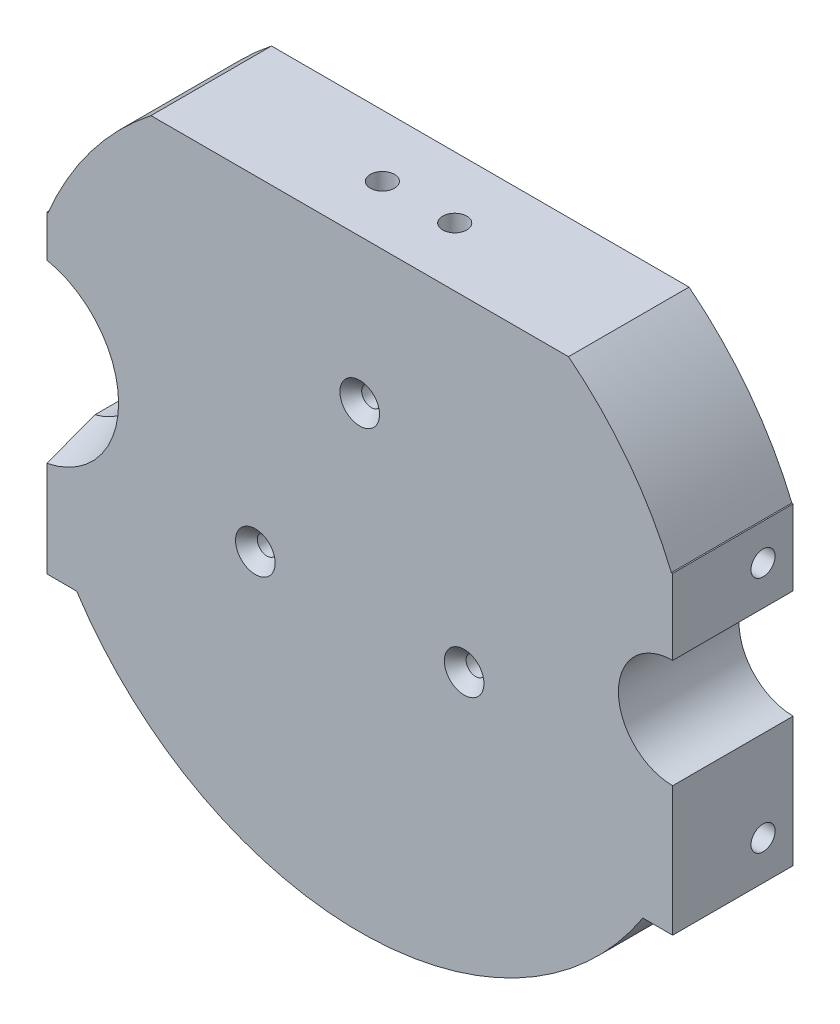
ISO-10303-21;
HEADER;
FILE_DESCRIPTION(('STEP AP214'),'2;1');
FILE_NAME('part.step','',(''),(''),'','','');
FILE_SCHEMA(('AUTOMOTIVE_DESIGN { 1 0 10303 214 1 1 1 1 }'));
ENDSEC;
DATA;
#1=APPLICATION_CONTEXT('core data for automotive mechanical design processes');
#2=APPLICATION_PROTOCOL_DEFINITION('international standard','automotive_design',2000,#1);
#3=PRODUCT_CONTEXT('',#1,'mechanical');
#4=PRODUCT('Part','Part','',(#3));
#5=PRODUCT_RELATED_PRODUCT_CATEGORY('part','',(#4));
#6=PRODUCT_DEFINITION_FORMATION('','',#4);
#7=PRODUCT_DEFINITION_CONTEXT('part definition',#1,'design');
#8=PRODUCT_DEFINITION('design','',#6,#7);
#9=PRODUCT_DEFINITION_SHAPE('','',#8);
#10=(LENGTH_UNIT() NAMED_UNIT(*) SI_UNIT(.MILLI.,.METRE.));
#11=(NAMED_UNIT(*) PLANE_ANGLE_UNIT() SI_UNIT($,.RADIAN.));
#12=(NAMED_UNIT(*) SI_UNIT($,.STERADIAN.) SOLID_ANGLE_UNIT());
#13=UNCERTAINTY_MEASURE_WITH_UNIT(LENGTH_MEASURE(1.E-05),#10,'distance_accuracy_value','');
#14=(GEOMETRIC_REPRESENTATION_CONTEXT(3) GLOBAL_UNCERTAINTY_ASSIGNED_CONTEXT((#13)) GLOBAL_UNIT_ASSIGNED_CONTEXT((#10,
#11,#12)) REPRESENTATION_CONTEXT('',''));
#15=CARTESIAN_POINT('',(0.,0.,0.));
#16=DIRECTION('',(0.,0.,1.));
#17=DIRECTION('',(1.,0.,0.));
#18=AXIS2_PLACEMENT_3D('',#15,#16,#17);
#19=CARTESIAN_POINT('',(0.,0.,-31.75));
#20=DIRECTION('',(0.,0.,1.));
#21=DIRECTION('',(1.,0.,0.));
#22=AXIS2_PLACEMENT_3D('',#19,#20,#21);
#23=CYLINDRICAL_SURFACE('',#22,88.9);
#24=DIRECTION('',(0.,0.,1.));
#25=VECTOR('',#24,1.);
#26=CARTESIAN_POINT('',(54.9926131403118,69.85,-31.75));
#27=LINE('',#26,#25);
#28=CARTESIAN_POINT('',(54.9926131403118,69.85,0.));
#29=VERTEX_POINT('',#28);
#30=CARTESIAN_POINT('',(54.9926131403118,69.85,-31.75));
#31=VERTEX_POINT('',#30);
#32=EDGE_CURVE('E229',#29,#31,#27,.F.);
#33=ORIENTED_EDGE('',*,*,#32,.F.);
#34=CARTESIAN_POINT('',(0.,0.,0.));
#35=DIRECTION('',(0.,0.,1.));
#36=DIRECTION('',(1.,0.,0.));
#37=AXIS2_PLACEMENT_3D('',#34,#35,#36);
#38=CIRCLE('',#37,88.9);
#39=CARTESIAN_POINT('',(82.084311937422,34.1376,0.));
#40=VERTEX_POINT('',#39);
#41=EDGE_CURVE('E296',#40,#29,#38,.T.);
#42=ORIENTED_EDGE('',*,*,#41,.F.);
#43=DIRECTION('',(0.,0.,1.));
#44=VECTOR('',#43,1.);
#45=CARTESIAN_POINT('',(82.084311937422,34.1376,-31.75));
#46=LINE('',#45,#44);
#47=CARTESIAN_POINT('',(82.084311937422,34.1376,-31.75));
#48=VERTEX_POINT('',#47);
#49=EDGE_CURVE('E330',#48,#40,#46,.T.);
#50=ORIENTED_EDGE('',*,*,#49,.F.);
#51=CARTESIAN_POINT('',(0.,0.,-31.75));
#52=DIRECTION('',(0.,0.,1.));
#53=DIRECTION('',(1.,0.,0.));
#54=AXIS2_PLACEMENT_3D('',#51,#52,#53);
#55=CIRCLE('',#54,88.9);
#56=EDGE_CURVE('E256',#48,#31,#55,.T.);
#57=ORIENTED_EDGE('',*,*,#56,.T.);
#58=EDGE_LOOP('',(#33,#42,#50,#57));
#59=FACE_BOUND('',#58,.T.);
#60=ADVANCED_FACE('F44',(#59),#23,.T.);
#61=DIRECTION('',(0.,0.,1.));
#62=VECTOR('',#61,1.);
#63=CARTESIAN_POINT('',(-54.9926131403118,69.85,-31.75));
#64=LINE('',#63,#62);
#65=CARTESIAN_POINT('',(-54.9926131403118,69.85,-31.75));
#66=VERTEX_POINT('',#65);
#67=CARTESIAN_POINT('',(-54.9926131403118,69.85,0.));
#68=VERTEX_POINT('',#67);
#69=EDGE_CURVE('E227',#66,#68,#64,.T.);
#70=ORIENTED_EDGE('',*,*,#69,.F.);
#71=CARTESIAN_POINT('',(-82.084311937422,34.1376,-31.75));
#72=VERTEX_POINT('',#71);
#73=EDGE_CURVE('E261',#66,#72,#55,.T.);
#74=ORIENTED_EDGE('',*,*,#73,.T.);
#75=DIRECTION('',(0.,0.,1.));
#76=VECTOR('',#75,1.);
#77=CARTESIAN_POINT('',(-82.084311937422,34.1376,-31.75));
#78=LINE('',#77,#76);
#79=CARTESIAN_POINT('',(-82.084311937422,34.1376,0.));
#80=VERTEX_POINT('',#79);
#81=EDGE_CURVE('E295',#72,#80,#78,.T.);
#82=ORIENTED_EDGE('',*,*,#81,.T.);
#83=EDGE_CURVE('E255',#68,#80,#38,.T.);
#84=ORIENTED_EDGE('',*,*,#83,.F.);
#85=EDGE_LOOP('',(#70,#74,#82,#84));
#86=FACE_BOUND('',#85,.T.);
#87=ADVANCED_FACE('F387',(#86),#23,.T.);
#88=CARTESIAN_POINT('',(82.084311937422,34.1376,-31.75));
#89=DIRECTION('',(0.,1.,0.));
#90=DIRECTION('',(-1.,0.,0.));
#91=AXIS2_PLACEMENT_3D('',#88,#89,#90);
#92=PLANE('',#91);
#93=DIRECTION('',(-1.,0.,0.));
#94=VECTOR('',#93,1.);
#95=CARTESIAN_POINT('',(82.084311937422,34.1376,0.));
#96=LINE('',#95,#94);
#97=CARTESIAN_POINT('',(82.423,34.1376,0.));
#98=VERTEX_POINT('',#97);
#99=EDGE_CURVE('E327',#98,#40,#96,.T.);
#100=ORIENTED_EDGE('',*,*,#99,.F.);
#101=DIRECTION('',(0.,0.,1.));
#102=VECTOR('',#101,1.);
#103=CARTESIAN_POINT('',(82.423,34.1376,-31.75));
#104=LINE('',#103,#102);
#105=CARTESIAN_POINT('',(82.423,34.1376,-31.75));
#106=VERTEX_POINT('',#105);
#107=EDGE_CURVE('E334',#106,#98,#104,.T.);
#108=ORIENTED_EDGE('',*,*,#107,.F.);
#109=DIRECTION('',(-1.,0.,0.));
#110=VECTOR('',#109,1.);
#111=CARTESIAN_POINT('',(82.084311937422,34.1376,-31.75));
#112=LINE('',#111,#110);
#113=EDGE_CURVE('E292',#106,#48,#112,.T.);
#114=ORIENTED_EDGE('',*,*,#113,.T.);
#115=ORIENTED_EDGE('',*,*,#49,.T.);
#116=EDGE_LOOP('',(#100,#108,#114,#115));
#117=FACE_BOUND('',#116,.T.);
#118=ADVANCED_FACE('F389',(#117),#92,.T.);
#119=CARTESIAN_POINT('',(82.423,34.1376,-31.75));
#120=DIRECTION('',(1.,0.,0.));
#121=DIRECTION('',(0.,0.,-1.));
#122=AXIS2_PLACEMENT_3D('',#119,#120,#121);
#123=PLANE('',#122);
#124=CARTESIAN_POINT('',(82.423,24.6126000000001,-23.8125));
#125=DIRECTION('',(1.,0.,0.));
#126=DIRECTION('',(0.,0.,-1.));
#127=AXIS2_PLACEMENT_3D('',#124,#125,#126);
#128=CIRCLE('',#127,3.175);
#129=CARTESIAN_POINT('',(82.423,24.6126000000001,-26.9875));
#130=VERTEX_POINT('',#129);
#131=EDGE_CURVE('E243',#130,#130,#128,.T.);
#132=ORIENTED_EDGE('',*,*,#131,.F.);
#133=EDGE_LOOP('',(#132));
#134=FACE_BOUND('',#133,.T.);
#135=DIRECTION('',(0.,1.,0.));
#136=VECTOR('',#135,1.);
#137=CARTESIAN_POINT('',(82.423,34.1376,0.));
#138=LINE('',#137,#136);
#139=CARTESIAN_POINT('',(82.423,14.2748,0.));
#140=VERTEX_POINT('',#139);
#141=EDGE_CURVE('E324',#140,#98,#138,.T.);
#142=ORIENTED_EDGE('',*,*,#141,.F.);
#143=DIRECTION('',(0.,0.,1.));
#144=VECTOR('',#143,1.);
#145=CARTESIAN_POINT('',(82.423,14.2748,-31.75));
#146=LINE('',#145,#144);
#147=CARTESIAN_POINT('',(82.423,14.2748,-31.75));
#148=VERTEX_POINT('',#147);
#149=EDGE_CURVE('E337',#148,#140,#146,.T.);
#150=ORIENTED_EDGE('',*,*,#149,.F.);
#151=DIRECTION('',(0.,1.,0.));
#152=VECTOR('',#151,1.);
#153=CARTESIAN_POINT('',(82.423,34.1376,-31.75));
#154=LINE('',#153,#152);
#155=EDGE_CURVE('E289',#148,#106,#154,.T.);
#156=ORIENTED_EDGE('',*,*,#155,.T.);
#157=ORIENTED_EDGE('',*,*,#107,.T.);
#158=EDGE_LOOP('',(#142,#150,#156,#157));
#159=FACE_BOUND('',#158,.T.);
#160=ADVANCED_FACE('F395',(#134,#159),#123,.T.);
#161=CARTESIAN_POINT('',(82.423,-0.0126999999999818,-31.75));
#162=DIRECTION('',(0.,0.,1.));
#163=DIRECTION('',(1.,0.,0.));
#164=AXIS2_PLACEMENT_3D('',#161,#162,#163);
#165=CYLINDRICAL_SURFACE('',#164,14.2875);
#166=CARTESIAN_POINT('',(82.423,-0.0126999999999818,0.));
#167=DIRECTION('',(0.,0.,-1.));
#168=DIRECTION('',(1.,0.,0.));
#169=AXIS2_PLACEMENT_3D('',#166,#167,#168);
#170=CIRCLE('',#169,14.2875);
#171=CARTESIAN_POINT('',(82.423,-14.3002,0.));
#172=VERTEX_POINT('',#171);
#173=EDGE_CURVE('E320',#172,#140,#170,.T.);
#174=ORIENTED_EDGE('',*,*,#173,.F.);
#175=DIRECTION('',(0.,0.,1.));
#176=VECTOR('',#175,1.);
#177=CARTESIAN_POINT('',(82.423,-14.3002,-31.75));
#178=LINE('',#177,#176);
#179=CARTESIAN_POINT('',(82.423,-14.3002,-31.75));
#180=VERTEX_POINT('',#179);
#181=EDGE_CURVE('E339',#180,#172,#178,.T.);
#182=ORIENTED_EDGE('',*,*,#181,.F.);
#183=CARTESIAN_POINT('',(82.423,-0.0126999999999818,-31.75));
#184=DIRECTION('',(0.,0.,-1.));
#185=DIRECTION('',(1.,0.,0.));
#186=AXIS2_PLACEMENT_3D('',#183,#184,#185);
#187=CIRCLE('',#186,14.2875);
#188=EDGE_CURVE('E285',#180,#148,#187,.T.);
#189=ORIENTED_EDGE('',*,*,#188,.T.);
#190=ORIENTED_EDGE('',*,*,#149,.T.);
#191=EDGE_LOOP('',(#174,#182,#189,#190));
#192=FACE_BOUND('',#191,.T.);
#193=ADVANCED_FACE('F427',(#192),#165,.F.);
#194=CARTESIAN_POINT('',(82.423,-14.3002,-31.75));
#195=DIRECTION('',(1.,0.,0.));
#196=DIRECTION('',(0.,0.,-1.));
#197=AXIS2_PLACEMENT_3D('',#194,#195,#196);
#198=PLANE('',#197);
#199=CARTESIAN_POINT('',(82.423,-38.1,-23.8125));
#200=DIRECTION('',(1.,0.,0.));
#201=DIRECTION('',(0.,0.,-1.));
#202=AXIS2_PLACEMENT_3D('',#199,#200,#201);
#203=CIRCLE('',#202,3.175);
#204=CARTESIAN_POINT('',(82.423,-38.1,-26.9875));
#205=VERTEX_POINT('',#204);
#206=EDGE_CURVE('E249',#205,#205,#203,.T.);
#207=ORIENTED_EDGE('',*,*,#206,.F.);
#208=EDGE_LOOP('',(#207));
#209=FACE_BOUND('',#208,.T.);
#210=DIRECTION('',(0.,1.,0.));
#211=VECTOR('',#210,1.);
#212=CARTESIAN_POINT('',(82.423,-14.3002,0.));
#213=LINE('',#212,#211);
#214=CARTESIAN_POINT('',(82.423,-48.4124,0.));
#215=VERTEX_POINT('',#214);
#216=EDGE_CURVE('E316',#215,#172,#213,.T.);
#217=ORIENTED_EDGE('',*,*,#216,.F.);
#218=DIRECTION('',(0.,0.,1.));
#219=VECTOR('',#218,1.);
#220=CARTESIAN_POINT('',(82.423,-48.4124,-31.75));
#221=LINE('',#220,#219);
#222=CARTESIAN_POINT('',(82.423,-48.4124,-31.75));
#223=VERTEX_POINT('',#222);
#224=EDGE_CURVE('E342',#223,#215,#221,.T.);
#225=ORIENTED_EDGE('',*,*,#224,.F.);
#226=DIRECTION('',(0.,1.,0.));
#227=VECTOR('',#226,1.);
#228=CARTESIAN_POINT('',(82.423,-14.3002,-31.75));
#229=LINE('',#228,#227);
#230=EDGE_CURVE('E282',#223,#180,#229,.T.);
#231=ORIENTED_EDGE('',*,*,#230,.T.);
#232=ORIENTED_EDGE('',*,*,#181,.T.);
#233=EDGE_LOOP('',(#217,#225,#231,#232));
#234=FACE_BOUND('',#233,.T.);
#235=ADVANCED_FACE('F430',(#209,#234),#198,.T.);
#236=CARTESIAN_POINT('',(82.423,-48.4124,-31.75));
#237=DIRECTION('',(0.,-1.,0.));
#238=DIRECTION('',(1.,0.,0.));
#239=AXIS2_PLACEMENT_3D('',#236,#237,#238);
#240=PLANE('',#239);
#241=DIRECTION('',(1.,0.,0.));
#242=VECTOR('',#241,1.);
#243=CARTESIAN_POINT('',(82.423,-48.4124,0.));
#244=LINE('',#243,#242);
#245=CARTESIAN_POINT('',(74.5617162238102,-48.4124,0.));
#246=VERTEX_POINT('',#245);
#247=EDGE_CURVE('E313',#246,#215,#244,.T.);
#248=ORIENTED_EDGE('',*,*,#247,.F.);
#249=DIRECTION('',(0.,0.,1.));
#250=VECTOR('',#249,1.);
#251=CARTESIAN_POINT('',(74.5617162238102,-48.4124,-31.75));
#252=LINE('',#251,#250);
#253=CARTESIAN_POINT('',(74.5617162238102,-48.4124,-31.75));
#254=VERTEX_POINT('',#253);
#255=EDGE_CURVE('E344',#254,#246,#252,.T.);
#256=ORIENTED_EDGE('',*,*,#255,.F.);
#257=DIRECTION('',(1.,0.,0.));
#258=VECTOR('',#257,1.);
#259=CARTESIAN_POINT('',(82.423,-48.4124,-31.75));
#260=LINE('',#259,#258);
#261=EDGE_CURVE('E279',#254,#223,#260,.T.);
#262=ORIENTED_EDGE('',*,*,#261,.T.);
#263=ORIENTED_EDGE('',*,*,#224,.T.);
#264=EDGE_LOOP('',(#248,#256,#262,#263));
#265=FACE_BOUND('',#264,.T.);
#266=ADVANCED_FACE('F435',(#265),#240,.T.);
#267=CARTESIAN_POINT('',(0.,0.,-31.75));
#268=DIRECTION('',(0.,0.,1.));
#269=DIRECTION('',(1.,0.,0.));
#270=AXIS2_PLACEMENT_3D('',#267,#268,#269);
#271=CYLINDRICAL_SURFACE('',#270,88.9);
#272=CARTESIAN_POINT('',(0.,0.,0.));
#273=DIRECTION('',(0.,0.,1.));
#274=DIRECTION('',(1.,0.,0.));
#275=AXIS2_PLACEMENT_3D('',#272,#273,#274);
#276=CIRCLE('',#275,88.9);
#277=CARTESIAN_POINT('',(-74.5617162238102,-48.4124,0.));
#278=VERTEX_POINT('',#277);
#279=EDGE_CURVE('E310',#278,#246,#276,.T.);
#280=ORIENTED_EDGE('',*,*,#279,.F.);
#281=DIRECTION('',(0.,0.,1.));
#282=VECTOR('',#281,1.);
#283=CARTESIAN_POINT('',(-74.5617162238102,-48.4124,-31.75));
#284=LINE('',#283,#282);
#285=CARTESIAN_POINT('',(-74.5617162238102,-48.4124,-31.75));
#286=VERTEX_POINT('',#285);
#287=EDGE_CURVE('E346',#286,#278,#284,.T.);
#288=ORIENTED_EDGE('',*,*,#287,.F.);
#289=CARTESIAN_POINT('',(0.,0.,-31.75));
#290=DIRECTION('',(0.,0.,1.));
#291=DIRECTION('',(1.,0.,0.));
#292=AXIS2_PLACEMENT_3D('',#289,#290,#291);
#293=CIRCLE('',#292,88.9);
#294=EDGE_CURVE('E276',#286,#254,#293,.T.);
#295=ORIENTED_EDGE('',*,*,#294,.T.);
#296=ORIENTED_EDGE('',*,*,#255,.T.);
#297=EDGE_LOOP('',(#280,#288,#295,#296));
#298=FACE_BOUND('',#297,.T.);
#299=ADVANCED_FACE('F438',(#298),#271,.T.);
#300=CARTESIAN_POINT('',(-82.423,-48.4124,-31.75));
#301=DIRECTION('',(0.,-1.,0.));
#302=DIRECTION('',(1.,0.,0.));
#303=AXIS2_PLACEMENT_3D('',#300,#301,#302);
#304=PLANE('',#303);
#305=DIRECTION('',(1.,0.,0.));
#306=VECTOR('',#305,1.);
#307=CARTESIAN_POINT('',(-82.423,-48.4124,0.));
#308=LINE('',#307,#306);
#309=CARTESIAN_POINT('',(-82.423,-48.4124,0.));
#310=VERTEX_POINT('',#309);
#311=EDGE_CURVE('E307',#310,#278,#308,.T.);
#312=ORIENTED_EDGE('',*,*,#311,.F.);
#313=DIRECTION('',(0.,0.,1.));
#314=VECTOR('',#313,1.);
#315=CARTESIAN_POINT('',(-82.423,-48.4124,-31.75));
#316=LINE('',#315,#314);
#317=CARTESIAN_POINT('',(-82.423,-48.4124,-31.75));
#318=VERTEX_POINT('',#317);
#319=EDGE_CURVE('E348',#318,#310,#316,.T.);
#320=ORIENTED_EDGE('',*,*,#319,.F.);
#321=DIRECTION('',(1.,0.,0.));
#322=VECTOR('',#321,1.);
#323=CARTESIAN_POINT('',(-82.423,-48.4124,-31.75));
#324=LINE('',#323,#322);
#325=EDGE_CURVE('E273',#318,#286,#324,.T.);
#326=ORIENTED_EDGE('',*,*,#325,.T.);
#327=ORIENTED_EDGE('',*,*,#287,.T.);
#328=EDGE_LOOP('',(#312,#320,#326,#327));
#329=FACE_BOUND('',#328,.T.);
#330=ADVANCED_FACE('F374',(#329),#304,.T.);
#331=CARTESIAN_POINT('',(-82.423,-18.4450831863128,-31.75));
#332=DIRECTION('',(-1.,0.,0.));
#333=DIRECTION('',(0.,-1.,0.));
#334=AXIS2_PLACEMENT_3D('',#331,#332,#333);
#335=PLANE('',#334);
#336=CARTESIAN_POINT('',(-82.423,-38.0999999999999,-23.8125));
#337=DIRECTION('',(-1.,0.,0.));
#338=DIRECTION('',(0.,0.,1.));
#339=AXIS2_PLACEMENT_3D('',#336,#337,#338);
#340=CIRCLE('',#339,3.175);
#341=CARTESIAN_POINT('',(-82.423,-38.0999999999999,-20.6375));
#342=VERTEX_POINT('',#341);
#343=EDGE_CURVE('E231',#342,#342,#340,.T.);
#344=ORIENTED_EDGE('',*,*,#343,.F.);
#345=EDGE_LOOP('',(#344));
#346=FACE_BOUND('',#345,.T.);
#347=DIRECTION('',(0.,-1.,0.));
#348=VECTOR('',#347,1.);
#349=CARTESIAN_POINT('',(-82.423,-18.4450831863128,0.));
#350=LINE('',#349,#348);
#351=CARTESIAN_POINT('',(-82.423,-23.1884056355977,0.));
#352=VERTEX_POINT('',#351);
#353=EDGE_CURVE('E305',#352,#310,#350,.T.);
#354=ORIENTED_EDGE('',*,*,#353,.F.);
#355=CARTESIAN_POINT('',(-82.423,-23.1884056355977,0.));
#356=CARTESIAN_POINT('',(-82.423,-22.7949112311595,-1.05899836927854));
#357=CARTESIAN_POINT('',(-82.423,-22.401069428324,-2.11786776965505));
#358=CARTESIAN_POINT('',(-82.423,-21.6125512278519,-4.23529468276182));
#359=CARTESIAN_POINT('',(-82.423,-21.217874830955,-5.29385219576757));
#360=CARTESIAN_POINT('',(-82.423,-20.4275468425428,-7.41060354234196));
#361=CARTESIAN_POINT('',(-82.423,-20.0318952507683,-8.46879737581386));
#362=CARTESIAN_POINT('',(-82.423,-19.2394186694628,-10.5847466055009));
#363=CARTESIAN_POINT('',(-82.423,-18.8425936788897,-11.6425020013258));
#364=CARTESIAN_POINT('',(-82.423,-18.4450831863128,-12.7));
#365=B_SPLINE_CURVE_WITH_KNOTS('',3,(#355,#356,#357,#358,#359,#360,#361,#362,#363,#364),
.UNSPECIFIED.,.F.,.F.,(4,2,2,2,4),(0.,3.38922397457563,6.77844494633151,10.1676668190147,
13.5568917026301),.UNSPECIFIED.);
#366=CARTESIAN_POINT('',(-82.423,-18.4450831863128,-12.7));
#367=VERTEX_POINT('',#366);
#368=EDGE_CURVE('E71',#352,#367,#365,.T.);
#369=ORIENTED_EDGE('',*,*,#368,.T.);
#370=DIRECTION('',(0.,0.,1.));
#371=VECTOR('',#370,1.);
#372=CARTESIAN_POINT('',(-82.423,-18.4450831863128,-31.75));
#373=LINE('',#372,#371);
#374=CARTESIAN_POINT('',(-82.423,-18.4450831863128,-31.75));
#375=VERTEX_POINT('',#374);
#376=EDGE_CURVE('E351',#375,#367,#373,.T.);
#377=ORIENTED_EDGE('',*,*,#376,.F.);
#378=DIRECTION('',(0.,-1.,0.));
#379=VECTOR('',#378,1.);
#380=CARTESIAN_POINT('',(-82.423,-18.4450831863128,-31.75));
#381=LINE('',#380,#379);
#382=EDGE_CURVE('E270',#375,#318,#381,.T.);
#383=ORIENTED_EDGE('',*,*,#382,.T.);
#384=ORIENTED_EDGE('',*,*,#319,.T.);
#385=EDGE_LOOP('',(#354,#369,#377,#383,#384));
#386=FACE_BOUND('',#385,.T.);
#387=ADVANCED_FACE('F368',(#346,#386),#335,.T.);
#388=CARTESIAN_POINT('',(-87.1855,0.,-31.75));
#389=DIRECTION('',(0.,0.,1.));
#390=DIRECTION('',(1.,0.,0.));
#391=AXIS2_PLACEMENT_3D('',#388,#389,#390);
#392=CYLINDRICAL_SURFACE('',#391,19.05);
#393=ORIENTED_EDGE('',*,*,#376,.T.);
#394=CARTESIAN_POINT('',(-87.1855,0.,-12.7));
#395=DIRECTION('',(0.,0.,1.));
#396=DIRECTION('',(1.,0.,0.));
#397=AXIS2_PLACEMENT_3D('',#394,#395,#396);
#398=CIRCLE('',#397,19.05);
#399=CARTESIAN_POINT('',(-82.423,18.4450831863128,-12.7));
#400=VERTEX_POINT('',#399);
#401=EDGE_CURVE('E57',#367,#400,#398,.T.);
#402=ORIENTED_EDGE('',*,*,#401,.T.);
#403=DIRECTION('',(0.,0.,1.));
#404=VECTOR('',#403,1.);
#405=CARTESIAN_POINT('',(-82.423,18.4450831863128,-31.75));
#406=LINE('',#405,#404);
#407=CARTESIAN_POINT('',(-82.423,18.4450831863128,-31.75));
#408=VERTEX_POINT('',#407);
#409=EDGE_CURVE('E354',#408,#400,#406,.T.);
#410=ORIENTED_EDGE('',*,*,#409,.F.);
#411=CARTESIAN_POINT('',(-87.1855,0.,-31.75));
#412=DIRECTION('',(0.,0.,-1.));
#413=DIRECTION('',(1.,0.,0.));
#414=AXIS2_PLACEMENT_3D('',#411,#412,#413);
#415=CIRCLE('',#414,19.05);
#416=EDGE_CURVE('E267',#408,#375,#415,.T.);
#417=ORIENTED_EDGE('',*,*,#416,.T.);
#418=EDGE_LOOP('',(#393,#402,#410,#417));
#419=FACE_BOUND('',#418,.T.);
#420=ADVANCED_FACE('F373',(#419),#392,.F.);
#421=CARTESIAN_POINT('',(-82.423,34.1376,-31.75));
#422=DIRECTION('',(-1.,0.,0.));
#423=DIRECTION('',(0.,-1.,0.));
#424=AXIS2_PLACEMENT_3D('',#421,#422,#423);
#425=PLANE('',#424);
#426=CARTESIAN_POINT('',(-82.423,24.6126000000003,-23.8125));
#427=DIRECTION('',(-1.,0.,0.));
#428=DIRECTION('',(0.,0.,1.));
#429=AXIS2_PLACEMENT_3D('',#426,#427,#428);
#430=CIRCLE('',#429,3.175);
#431=CARTESIAN_POINT('',(-82.423,24.6126000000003,-20.6375));
#432=VERTEX_POINT('',#431);
#433=EDGE_CURVE('E237',#432,#432,#430,.T.);
#434=ORIENTED_EDGE('',*,*,#433,.F.);
#435=EDGE_LOOP('',(#434));
#436=FACE_BOUND('',#435,.T.);
#437=ORIENTED_EDGE('',*,*,#409,.T.);
#438=CARTESIAN_POINT('',(-82.423,18.4450831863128,-12.7));
#439=CARTESIAN_POINT('',(-82.423,18.8425936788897,-11.6425020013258));
#440=CARTESIAN_POINT('',(-82.423,19.2394186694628,-10.5847466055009));
#441=CARTESIAN_POINT('',(-82.423,20.0318952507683,-8.46879737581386));
#442=CARTESIAN_POINT('',(-82.423,20.4275468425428,-7.41060354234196));
#443=CARTESIAN_POINT('',(-82.423,21.217874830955,-5.29385219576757));
#444=CARTESIAN_POINT('',(-82.423,21.6125512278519,-4.23529468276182));
#445=CARTESIAN_POINT('',(-82.423,22.401069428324,-2.11786776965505));
#446=CARTESIAN_POINT('',(-82.423,22.7949112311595,-1.05899836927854));
#447=CARTESIAN_POINT('',(-82.423,23.1884056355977,0.));
#448=B_SPLINE_CURVE_WITH_KNOTS('',3,(#438,#439,#440,#441,#442,#443,#444,#445,#446,#447),
.UNSPECIFIED.,.F.,.F.,(4,2,2,2,4),(0.,3.38922488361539,6.77844675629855,10.1676677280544,
13.5568917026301),.UNSPECIFIED.);
#449=CARTESIAN_POINT('',(-82.423,23.1884056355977,0.));
#450=VERTEX_POINT('',#449);
#451=EDGE_CURVE('E11',#400,#450,#448,.T.);
#452=ORIENTED_EDGE('',*,*,#451,.T.);
#453=DIRECTION('',(0.,-1.,0.));
#454=VECTOR('',#453,1.);
#455=CARTESIAN_POINT('',(-82.423,34.1376,0.));
#456=LINE('',#455,#454);
#457=CARTESIAN_POINT('',(-82.423,34.1376,0.));
#458=VERTEX_POINT('',#457);
#459=EDGE_CURVE('E302',#458,#450,#456,.T.);
#460=ORIENTED_EDGE('',*,*,#459,.F.);
#461=DIRECTION('',(0.,0.,1.));
#462=VECTOR('',#461,1.);
#463=CARTESIAN_POINT('',(-82.423,34.1376,-31.75));
#464=LINE('',#463,#462);
#465=CARTESIAN_POINT('',(-82.423,34.1376,-31.75));
#466=VERTEX_POINT('',#465);
#467=EDGE_CURVE('E356',#466,#458,#464,.T.);
#468=ORIENTED_EDGE('',*,*,#467,.F.);
#469=DIRECTION('',(0.,-1.,0.));
#470=VECTOR('',#469,1.);
#471=CARTESIAN_POINT('',(-82.423,34.1376,-31.75));
#472=LINE('',#471,#470);
#473=EDGE_CURVE('E264',#466,#408,#472,.T.);
#474=ORIENTED_EDGE('',*,*,#473,.T.);
#475=EDGE_LOOP('',(#437,#452,#460,#468,#474));
#476=FACE_BOUND('',#475,.T.);
#477=ADVANCED_FACE('F378',(#436,#476),#425,.T.);
#478=CARTESIAN_POINT('',(-82.423,34.1376,-31.75));
#479=DIRECTION('',(0.,1.,0.));
#480=DIRECTION('',(-1.,0.,0.));
#481=AXIS2_PLACEMENT_3D('',#478,#479,#480);
#482=PLANE('',#481);
#483=DIRECTION('',(-1.,0.,0.));
#484=VECTOR('',#483,1.);
#485=CARTESIAN_POINT('',(-82.423,34.1376,0.));
#486=LINE('',#485,#484);
#487=EDGE_CURVE('E299',#80,#458,#486,.T.);
#488=ORIENTED_EDGE('',*,*,#487,.F.);
#489=ORIENTED_EDGE('',*,*,#81,.F.);
#490=DIRECTION('',(-1.,0.,0.));
#491=VECTOR('',#490,1.);
#492=CARTESIAN_POINT('',(-82.423,34.1376,-31.75));
#493=LINE('',#492,#491);
#494=EDGE_CURVE('E260',#72,#466,#493,.T.);
#495=ORIENTED_EDGE('',*,*,#494,.T.);
#496=ORIENTED_EDGE('',*,*,#467,.T.);
#497=EDGE_LOOP('',(#488,#489,#495,#496));
#498=FACE_BOUND('',#497,.T.);
#499=ADVANCED_FACE('F382',(#498),#482,.T.);
#500=CARTESIAN_POINT('',(0.,0.,-31.75));
#501=DIRECTION('',(0.,0.,1.));
#502=DIRECTION('',(1.,0.,0.));
#503=AXIS2_PLACEMENT_3D('',#500,#501,#502);
#504=PLANE('',#503);
#505=CARTESIAN_POINT('',(0.,31.75,-31.75));
#506=DIRECTION('',(0.,0.,1.));
#507=DIRECTION('',(1.,0.,0.));
#508=AXIS2_PLACEMENT_3D('',#505,#506,#507);
#509=CIRCLE('',#508,2.55269999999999);
#510=CARTESIAN_POINT('',(2.55269999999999,31.75,-31.75));
#511=VERTEX_POINT('',#510);
#512=EDGE_CURVE('E200',#511,#511,#509,.T.);
#513=ORIENTED_EDGE('',*,*,#512,.T.);
#514=EDGE_LOOP('',(#513));
#515=FACE_BOUND('',#514,.T.);
#516=CARTESIAN_POINT('',(27.4963065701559,-15.8750000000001,-31.75));
#517=DIRECTION('',(0.,0.,1.));
#518=DIRECTION('',(1.,0.,0.));
#519=AXIS2_PLACEMENT_3D('',#516,#517,#518);
#520=CIRCLE('',#519,2.55269999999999);
#521=CARTESIAN_POINT('',(30.0490065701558,-15.8750000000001,-31.75));
#522=VERTEX_POINT('',#521);
#523=EDGE_CURVE('E210',#522,#522,#520,.T.);
#524=ORIENTED_EDGE('',*,*,#523,.T.);
#525=EDGE_LOOP('',(#524));
#526=FACE_BOUND('',#525,.T.);
#527=CARTESIAN_POINT('',(-27.4963065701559,-15.8750000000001,-31.75));
#528=DIRECTION('',(0.,0.,1.));
#529=DIRECTION('',(1.,0.,0.));
#530=AXIS2_PLACEMENT_3D('',#527,#528,#529);
#531=CIRCLE('',#530,2.55269999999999);
#532=CARTESIAN_POINT('',(-24.9436065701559,-15.8750000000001,-31.75));
#533=VERTEX_POINT('',#532);
#534=EDGE_CURVE('E221',#533,#533,#531,.T.);
#535=ORIENTED_EDGE('',*,*,#534,.T.);
#536=EDGE_LOOP('',(#535));
#537=FACE_BOUND('',#536,.T.);
#538=ORIENTED_EDGE('',*,*,#73,.F.);
#539=DIRECTION('',(1.,0.,0.));
#540=VECTOR('',#539,1.);
#541=CARTESIAN_POINT('',(127.475731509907,69.85,-31.75));
#542=LINE('',#541,#540);
#543=EDGE_CURVE('E224',#66,#31,#542,.T.);
#544=ORIENTED_EDGE('',*,*,#543,.T.);
#545=ORIENTED_EDGE('',*,*,#56,.F.);
#546=ORIENTED_EDGE('',*,*,#113,.F.);
#547=ORIENTED_EDGE('',*,*,#155,.F.);
#548=ORIENTED_EDGE('',*,*,#188,.F.);
#549=ORIENTED_EDGE('',*,*,#230,.F.);
#550=ORIENTED_EDGE('',*,*,#261,.F.);
#551=ORIENTED_EDGE('',*,*,#294,.F.);
#552=ORIENTED_EDGE('',*,*,#325,.F.);
#553=ORIENTED_EDGE('',*,*,#382,.F.);
#554=ORIENTED_EDGE('',*,*,#416,.F.);
#555=ORIENTED_EDGE('',*,*,#473,.F.);
#556=ORIENTED_EDGE('',*,*,#494,.F.);
#557=EDGE_LOOP('',(#538,#544,#545,#546,#547,#548,#549,#550,#551,#552,#553,#554,#555,#556));
#558=FACE_BOUND('',#557,.T.);
#559=ADVANCED_FACE('F385',(#515,#526,#537,#558),#504,.F.);
#560=CARTESIAN_POINT('',(0.,0.,0.));
#561=DIRECTION('',(0.,0.,1.));
#562=DIRECTION('',(1.,0.,0.));
#563=AXIS2_PLACEMENT_3D('',#560,#561,#562);
#564=PLANE('',#563);
#565=CARTESIAN_POINT('',(0.,31.75,0.));
#566=DIRECTION('',(0.,0.,1.));
#567=DIRECTION('',(1.,0.,0.));
#568=AXIS2_PLACEMENT_3D('',#565,#566,#567);
#569=CIRCLE('',#568,5.2197);
#570=CARTESIAN_POINT('',(5.2197,31.75,0.));
#571=VERTEX_POINT('',#570);
#572=EDGE_CURVE('E192',#571,#571,#569,.T.);
#573=ORIENTED_EDGE('',*,*,#572,.F.);
#574=EDGE_LOOP('',(#573));
#575=FACE_BOUND('',#574,.T.);
#576=CARTESIAN_POINT('',(27.4963065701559,-15.8750000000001,0.));
#577=DIRECTION('',(0.,0.,1.));
#578=DIRECTION('',(1.,0.,0.));
#579=AXIS2_PLACEMENT_3D('',#576,#577,#578);
#580=CIRCLE('',#579,5.2197);
#581=CARTESIAN_POINT('',(32.7160065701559,-15.8750000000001,0.));
#582=VERTEX_POINT('',#581);
#583=EDGE_CURVE('E204',#582,#582,#580,.T.);
#584=ORIENTED_EDGE('',*,*,#583,.F.);
#585=EDGE_LOOP('',(#584));
#586=FACE_BOUND('',#585,.T.);
#587=CARTESIAN_POINT('',(-27.4963065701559,-15.8750000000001,0.));
#588=DIRECTION('',(0.,0.,1.));
#589=DIRECTION('',(1.,0.,0.));
#590=AXIS2_PLACEMENT_3D('',#587,#588,#589);
#591=CIRCLE('',#590,5.2197);
#592=CARTESIAN_POINT('',(-22.2766065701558,-15.8750000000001,0.));
#593=VERTEX_POINT('',#592);
#594=EDGE_CURVE('E213',#593,#593,#591,.T.);
#595=ORIENTED_EDGE('',*,*,#594,.F.);
#596=EDGE_LOOP('',(#595));
#597=FACE_BOUND('',#596,.T.);
#598=ORIENTED_EDGE('',*,*,#459,.T.);
#599=CARTESIAN_POINT('',(-87.1855,0.,0.));
#600=DIRECTION('',(0.,0.,1.));
#601=DIRECTION('',(1.,0.,0.));
#602=AXIS2_PLACEMENT_3D('',#599,#600,#601);
#603=CIRCLE('',#602,23.6724219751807);
#604=EDGE_CURVE('E361',#450,#352,#603,.F.);
#605=ORIENTED_EDGE('',*,*,#604,.T.);
#606=ORIENTED_EDGE('',*,*,#353,.T.);
#607=ORIENTED_EDGE('',*,*,#311,.T.);
#608=ORIENTED_EDGE('',*,*,#279,.T.);
#609=ORIENTED_EDGE('',*,*,#247,.T.);
#610=ORIENTED_EDGE('',*,*,#216,.T.);
#611=ORIENTED_EDGE('',*,*,#173,.T.);
#612=ORIENTED_EDGE('',*,*,#141,.T.);
#613=ORIENTED_EDGE('',*,*,#99,.T.);
#614=ORIENTED_EDGE('',*,*,#41,.T.);
#615=DIRECTION('',(1.,0.,0.));
#616=VECTOR('',#615,1.);
#617=CARTESIAN_POINT('',(0.,69.85,0.));
#618=LINE('',#617,#616);
#619=EDGE_CURVE('E333',#68,#29,#618,.T.);
#620=ORIENTED_EDGE('',*,*,#619,.F.);
#621=ORIENTED_EDGE('',*,*,#83,.T.);
#622=ORIENTED_EDGE('',*,*,#487,.T.);
#623=EDGE_LOOP('',(#598,#605,#606,#607,#608,#609,#610,#611,#612,#613,#614,#620,#621,#622));
#624=FACE_BOUND('',#623,.T.);
#625=ADVANCED_FACE('F413',(#575,#586,#597,#624),#564,.T.);
#626=CARTESIAN_POINT('',(72.898,-38.1,-23.8125));
#627=DIRECTION('',(1.,0.,0.));
#628=DIRECTION('',(0.,0.,-1.));
#629=AXIS2_PLACEMENT_3D('',#626,#627,#628);
#630=CONICAL_SURFACE('',#629,3.175,1.02974425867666);
#631=CARTESIAN_POINT('',(70.9902675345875,-38.1,-23.8125));
#632=VERTEX_POINT('',#631);
#633=VERTEX_LOOP('',#632);
#634=FACE_BOUND('',#633,.T.);
#635=CARTESIAN_POINT('',(72.898,-38.1,-23.8125));
#636=DIRECTION('',(1.,0.,0.));
#637=DIRECTION('',(0.,0.,-1.));
#638=AXIS2_PLACEMENT_3D('',#635,#636,#637);
#639=CIRCLE('',#638,3.175);
#640=CARTESIAN_POINT('',(72.898,-38.1,-26.9875));
#641=VERTEX_POINT('',#640);
#642=EDGE_CURVE('E252',#641,#641,#639,.T.);
#643=ORIENTED_EDGE('',*,*,#642,.T.);
#644=EDGE_LOOP('',(#643));
#645=FACE_BOUND('',#644,.T.);
#646=ADVANCED_FACE('F517',(#634,#645),#630,.F.);
#647=CARTESIAN_POINT('',(82.423,-38.1,-23.8125));
#648=DIRECTION('',(1.,0.,0.));
#649=DIRECTION('',(0.,0.,-1.));
#650=AXIS2_PLACEMENT_3D('',#647,#648,#649);
#651=CYLINDRICAL_SURFACE('',#650,3.175);
#652=ORIENTED_EDGE('',*,*,#642,.F.);
#653=EDGE_LOOP('',(#652));
#654=FACE_BOUND('',#653,.T.);
#655=ORIENTED_EDGE('',*,*,#206,.T.);
#656=EDGE_LOOP('',(#655));
#657=FACE_BOUND('',#656,.T.);
#658=ADVANCED_FACE('F513',(#654,#657),#651,.F.);
#659=CARTESIAN_POINT('',(72.898,24.6126000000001,-23.8125));
#660=DIRECTION('',(1.,0.,0.));
#661=DIRECTION('',(0.,0.,-1.));
#662=AXIS2_PLACEMENT_3D('',#659,#660,#661);
#663=CONICAL_SURFACE('',#662,3.175,1.02974425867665);
#664=CARTESIAN_POINT('',(70.9902675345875,24.6126,-23.8125));
#665=VERTEX_POINT('',#664);
#666=VERTEX_LOOP('',#665);
#667=FACE_BOUND('',#666,.T.);
#668=CARTESIAN_POINT('',(72.898,24.6126000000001,-23.8125));
#669=DIRECTION('',(1.,0.,0.));
#670=DIRECTION('',(0.,0.,-1.));
#671=AXIS2_PLACEMENT_3D('',#668,#669,#670);
#672=CIRCLE('',#671,3.175);
#673=CARTESIAN_POINT('',(72.898,24.6126000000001,-26.9875));
#674=VERTEX_POINT('',#673);
#675=EDGE_CURVE('E246',#674,#674,#672,.T.);
#676=ORIENTED_EDGE('',*,*,#675,.T.);
#677=EDGE_LOOP('',(#676));
#678=FACE_BOUND('',#677,.T.);
#679=ADVANCED_FACE('F509',(#667,#678),#663,.F.);
#680=CARTESIAN_POINT('',(82.423,24.6126000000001,-23.8125));
#681=DIRECTION('',(1.,0.,0.));
#682=DIRECTION('',(0.,0.,-1.));
#683=AXIS2_PLACEMENT_3D('',#680,#681,#682);
#684=CYLINDRICAL_SURFACE('',#683,3.175);
#685=ORIENTED_EDGE('',*,*,#675,.F.);
#686=EDGE_LOOP('',(#685));
#687=FACE_BOUND('',#686,.T.);
#688=ORIENTED_EDGE('',*,*,#131,.T.);
#689=EDGE_LOOP('',(#688));
#690=FACE_BOUND('',#689,.T.);
#691=ADVANCED_FACE('F505',(#687,#690),#684,.F.);
#692=CARTESIAN_POINT('',(-72.898,24.6126000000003,-23.8125));
#693=DIRECTION('',(-1.,0.,0.));
#694=DIRECTION('',(0.,0.,1.));
#695=AXIS2_PLACEMENT_3D('',#692,#693,#694);
#696=CONICAL_SURFACE('',#695,3.175,1.02974425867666);
#697=CARTESIAN_POINT('',(-70.9902675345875,24.6126000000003,-23.8125));
#698=VERTEX_POINT('',#697);
#699=VERTEX_LOOP('',#698);
#700=FACE_BOUND('',#699,.T.);
#701=CARTESIAN_POINT('',(-72.898,24.6126000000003,-23.8125));
#702=DIRECTION('',(-1.,0.,0.));
#703=DIRECTION('',(0.,0.,1.));
#704=AXIS2_PLACEMENT_3D('',#701,#702,#703);
#705=CIRCLE('',#704,3.175);
#706=CARTESIAN_POINT('',(-72.898,24.6126000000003,-20.6375));
#707=VERTEX_POINT('',#706);
#708=EDGE_CURVE('E240',#707,#707,#705,.T.);
#709=ORIENTED_EDGE('',*,*,#708,.T.);
#710=EDGE_LOOP('',(#709));
#711=FACE_BOUND('',#710,.T.);
#712=ADVANCED_FACE('F501',(#700,#711),#696,.F.);
#713=CARTESIAN_POINT('',(-82.423,24.6126000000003,-23.8125));
#714=DIRECTION('',(-1.,0.,0.));
#715=DIRECTION('',(0.,0.,1.));
#716=AXIS2_PLACEMENT_3D('',#713,#714,#715);
#717=CYLINDRICAL_SURFACE('',#716,3.175);
#718=ORIENTED_EDGE('',*,*,#708,.F.);
#719=EDGE_LOOP('',(#718));
#720=FACE_BOUND('',#719,.T.);
#721=ORIENTED_EDGE('',*,*,#433,.T.);
#722=EDGE_LOOP('',(#721));
#723=FACE_BOUND('',#722,.T.);
#724=ADVANCED_FACE('F497',(#720,#723),#717,.F.);
#725=CARTESIAN_POINT('',(-72.898,-38.0999999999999,-23.8125));
#726=DIRECTION('',(-1.,0.,0.));
#727=DIRECTION('',(0.,0.,1.));
#728=AXIS2_PLACEMENT_3D('',#725,#726,#727);
#729=CONICAL_SURFACE('',#728,3.175,1.02974425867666);
#730=CARTESIAN_POINT('',(-70.9902675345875,-38.0999999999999,-23.8125));
#731=VERTEX_POINT('',#730);
#732=VERTEX_LOOP('',#731);
#733=FACE_BOUND('',#732,.T.);
#734=CARTESIAN_POINT('',(-72.898,-38.0999999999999,-23.8125));
#735=DIRECTION('',(-1.,0.,0.));
#736=DIRECTION('',(0.,0.,1.));
#737=AXIS2_PLACEMENT_3D('',#734,#735,#736);
#738=CIRCLE('',#737,3.175);
#739=CARTESIAN_POINT('',(-72.898,-38.0999999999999,-20.6375));
#740=VERTEX_POINT('',#739);
#741=EDGE_CURVE('E234',#740,#740,#738,.T.);
#742=ORIENTED_EDGE('',*,*,#741,.T.);
#743=EDGE_LOOP('',(#742));
#744=FACE_BOUND('',#743,.T.);
#745=ADVANCED_FACE('F493',(#733,#744),#729,.F.);
#746=CARTESIAN_POINT('',(-82.423,-38.0999999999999,-23.8125));
#747=DIRECTION('',(-1.,0.,0.));
#748=DIRECTION('',(0.,0.,1.));
#749=AXIS2_PLACEMENT_3D('',#746,#747,#748);
#750=CYLINDRICAL_SURFACE('',#749,3.175);
#751=ORIENTED_EDGE('',*,*,#741,.F.);
#752=EDGE_LOOP('',(#751));
#753=FACE_BOUND('',#752,.T.);
#754=ORIENTED_EDGE('',*,*,#343,.T.);
#755=EDGE_LOOP('',(#754));
#756=FACE_BOUND('',#755,.T.);
#757=ADVANCED_FACE('F489',(#753,#756),#750,.F.);
#758=CARTESIAN_POINT('',(127.475731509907,69.85,-31.75));
#759=DIRECTION('',(0.,-1.,0.));
#760=DIRECTION('',(1.,0.,0.));
#761=AXIS2_PLACEMENT_3D('',#758,#759,#760);
#762=PLANE('',#761);
#763=CARTESIAN_POINT('',(-9.52500000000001,69.85,-15.494));
#764=DIRECTION('',(0.,1.,0.));
#765=DIRECTION('',(0.,0.,1.));
#766=AXIS2_PLACEMENT_3D('',#763,#764,#765);
#767=CIRCLE('',#766,3.17499999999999);
#768=CARTESIAN_POINT('',(-9.52500000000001,69.85,-12.319));
#769=VERTEX_POINT('',#768);
#770=EDGE_CURVE('E182',#769,#769,#767,.T.);
#771=ORIENTED_EDGE('',*,*,#770,.F.);
#772=EDGE_LOOP('',(#771));
#773=FACE_BOUND('',#772,.T.);
#774=CARTESIAN_POINT('',(9.52499999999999,69.85,-15.494));
#775=DIRECTION('',(0.,1.,0.));
#776=DIRECTION('',(0.,0.,1.));
#777=AXIS2_PLACEMENT_3D('',#774,#775,#776);
#778=CIRCLE('',#777,3.17499999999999);
#779=CARTESIAN_POINT('',(9.52499999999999,69.85,-12.319));
#780=VERTEX_POINT('',#779);
#781=EDGE_CURVE('E181',#780,#780,#778,.T.);
#782=ORIENTED_EDGE('',*,*,#781,.F.);
#783=EDGE_LOOP('',(#782));
#784=FACE_BOUND('',#783,.T.);
#785=ORIENTED_EDGE('',*,*,#32,.T.);
#786=ORIENTED_EDGE('',*,*,#543,.F.);
#787=ORIENTED_EDGE('',*,*,#69,.T.);
#788=ORIENTED_EDGE('',*,*,#619,.T.);
#789=EDGE_LOOP('',(#785,#786,#787,#788));
#790=FACE_BOUND('',#789,.T.);
#791=ADVANCED_FACE('F417',(#773,#784,#790),#762,.F.);
#792=CARTESIAN_POINT('',(-27.4963065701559,-15.8750000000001,0.));
#793=DIRECTION('',(0.,0.,1.));
#794=DIRECTION('',(1.,0.,0.));
#795=AXIS2_PLACEMENT_3D('',#792,#793,#794);
#796=CYLINDRICAL_SURFACE('',#795,2.55269999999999);
#797=ORIENTED_EDGE('',*,*,#534,.F.);
#798=EDGE_LOOP('',(#797));
#799=FACE_BOUND('',#798,.T.);
#800=CARTESIAN_POINT('',(-27.4963065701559,-15.8750000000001,-3.06803254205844));
#801=DIRECTION('',(0.,0.,1.));
#802=DIRECTION('',(1.,0.,0.));
#803=AXIS2_PLACEMENT_3D('',#800,#801,#802);
#804=CIRCLE('',#803,2.5527);
#805=CARTESIAN_POINT('',(-24.9436065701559,-15.8750000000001,-3.06803254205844));
#806=VERTEX_POINT('',#805);
#807=EDGE_CURVE('E217',#806,#806,#804,.T.);
#808=ORIENTED_EDGE('',*,*,#807,.T.);
#809=EDGE_LOOP('',(#808));
#810=FACE_BOUND('',#809,.T.);
#811=ADVANCED_FACE('F482',(#799,#810),#796,.F.);
#812=CARTESIAN_POINT('',(-27.4963065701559,-15.8750000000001,0.));
#813=DIRECTION('',(0.,0.,1.));
#814=DIRECTION('',(1.,0.,0.));
#815=AXIS2_PLACEMENT_3D('',#812,#813,#814);
#816=CONICAL_SURFACE('',#815,5.2197,0.715584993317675);
#817=ORIENTED_EDGE('',*,*,#807,.F.);
#818=EDGE_LOOP('',(#817));
#819=FACE_BOUND('',#818,.T.);
#820=ORIENTED_EDGE('',*,*,#594,.T.);
#821=EDGE_LOOP('',(#820));
#822=FACE_BOUND('',#821,.T.);
#823=ADVANCED_FACE('F478',(#819,#822),#816,.F.);
#824=CARTESIAN_POINT('',(27.4963065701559,-15.8750000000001,0.));
#825=DIRECTION('',(0.,0.,1.));
#826=DIRECTION('',(1.,0.,0.));
#827=AXIS2_PLACEMENT_3D('',#824,#825,#826);
#828=CYLINDRICAL_SURFACE('',#827,2.55269999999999);
#829=ORIENTED_EDGE('',*,*,#523,.F.);
#830=EDGE_LOOP('',(#829));
#831=FACE_BOUND('',#830,.T.);
#832=CARTESIAN_POINT('',(27.4963065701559,-15.8750000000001,-3.06803254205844));
#833=DIRECTION('',(0.,0.,1.));
#834=DIRECTION('',(1.,0.,0.));
#835=AXIS2_PLACEMENT_3D('',#832,#833,#834);
#836=CIRCLE('',#835,2.5527);
#837=CARTESIAN_POINT('',(30.0490065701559,-15.8750000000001,-3.06803254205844));
#838=VERTEX_POINT('',#837);
#839=EDGE_CURVE('E207',#838,#838,#836,.T.);
#840=ORIENTED_EDGE('',*,*,#839,.T.);
#841=EDGE_LOOP('',(#840));
#842=FACE_BOUND('',#841,.T.);
#843=ADVANCED_FACE('F474',(#831,#842),#828,.F.);
#844=CARTESIAN_POINT('',(27.4963065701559,-15.8750000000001,0.));
#845=DIRECTION('',(0.,0.,1.));
#846=DIRECTION('',(1.,0.,0.));
#847=AXIS2_PLACEMENT_3D('',#844,#845,#846);
#848=CONICAL_SURFACE('',#847,5.2197,0.715584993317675);
#849=ORIENTED_EDGE('',*,*,#839,.F.);
#850=EDGE_LOOP('',(#849));
#851=FACE_BOUND('',#850,.T.);
#852=ORIENTED_EDGE('',*,*,#583,.T.);
#853=EDGE_LOOP('',(#852));
#854=FACE_BOUND('',#853,.T.);
#855=ADVANCED_FACE('F470',(#851,#854),#848,.F.);
#856=CARTESIAN_POINT('',(0.,31.75,0.));
#857=DIRECTION('',(0.,0.,1.));
#858=DIRECTION('',(1.,0.,0.));
#859=AXIS2_PLACEMENT_3D('',#856,#857,#858);
#860=CYLINDRICAL_SURFACE('',#859,2.55269999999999);
#861=ORIENTED_EDGE('',*,*,#512,.F.);
#862=EDGE_LOOP('',(#861));
#863=FACE_BOUND('',#862,.T.);
#864=CARTESIAN_POINT('',(0.,31.75,-3.06803254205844));
#865=DIRECTION('',(0.,0.,1.));
#866=DIRECTION('',(1.,0.,0.));
#867=AXIS2_PLACEMENT_3D('',#864,#865,#866);
#868=CIRCLE('',#867,2.5527);
#869=CARTESIAN_POINT('',(2.5527,31.75,-3.06803254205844));
#870=VERTEX_POINT('',#869);
#871=EDGE_CURVE('E196',#870,#870,#868,.T.);
#872=ORIENTED_EDGE('',*,*,#871,.T.);
#873=EDGE_LOOP('',(#872));
#874=FACE_BOUND('',#873,.T.);
#875=ADVANCED_FACE('F466',(#863,#874),#860,.F.);
#876=CARTESIAN_POINT('',(0.,31.75,0.));
#877=DIRECTION('',(0.,0.,1.));
#878=DIRECTION('',(1.,0.,0.));
#879=AXIS2_PLACEMENT_3D('',#876,#877,#878);
#880=CONICAL_SURFACE('',#879,5.2197,0.715584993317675);
#881=ORIENTED_EDGE('',*,*,#871,.F.);
#882=EDGE_LOOP('',(#881));
#883=FACE_BOUND('',#882,.T.);
#884=ORIENTED_EDGE('',*,*,#572,.T.);
#885=EDGE_LOOP('',(#884));
#886=FACE_BOUND('',#885,.T.);
#887=ADVANCED_FACE('F462',(#883,#886),#880,.F.);
#888=CARTESIAN_POINT('',(9.52499999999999,60.325,-15.494));
#889=DIRECTION('',(0.,1.,0.));
#890=DIRECTION('',(0.,0.,1.));
#891=AXIS2_PLACEMENT_3D('',#888,#889,#890);
#892=CONICAL_SURFACE('',#891,3.175,1.02974425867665);
#893=CARTESIAN_POINT('',(9.52499999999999,58.4172675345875,-15.494));
#894=VERTEX_POINT('',#893);
#895=VERTEX_LOOP('',#894);
#896=FACE_BOUND('',#895,.T.);
#897=CARTESIAN_POINT('',(9.52499999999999,60.325,-15.494));
#898=DIRECTION('',(0.,1.,0.));
#899=DIRECTION('',(0.,0.,1.));
#900=AXIS2_PLACEMENT_3D('',#897,#898,#899);
#901=CIRCLE('',#900,3.175);
#902=CARTESIAN_POINT('',(9.52499999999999,60.325,-12.319));
#903=VERTEX_POINT('',#902);
#904=EDGE_CURVE('E185',#903,#903,#901,.T.);
#905=ORIENTED_EDGE('',*,*,#904,.T.);
#906=EDGE_LOOP('',(#905));
#907=FACE_BOUND('',#906,.T.);
#908=ADVANCED_FACE('F458',(#896,#907),#892,.F.);
#909=CARTESIAN_POINT('',(9.52499999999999,69.85,-15.494));
#910=DIRECTION('',(0.,1.,0.));
#911=DIRECTION('',(0.,0.,1.));
#912=AXIS2_PLACEMENT_3D('',#909,#910,#911);
#913=CYLINDRICAL_SURFACE('',#912,3.17499999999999);
#914=ORIENTED_EDGE('',*,*,#904,.F.);
#915=EDGE_LOOP('',(#914));
#916=FACE_BOUND('',#915,.T.);
#917=ORIENTED_EDGE('',*,*,#781,.T.);
#918=EDGE_LOOP('',(#917));
#919=FACE_BOUND('',#918,.T.);
#920=ADVANCED_FACE('F175',(#916,#919),#913,.F.);
#921=CARTESIAN_POINT('',(-9.52500000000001,60.325,-15.494));
#922=DIRECTION('',(0.,1.,0.));
#923=DIRECTION('',(0.,0.,1.));
#924=AXIS2_PLACEMENT_3D('',#921,#922,#923);
#925=CONICAL_SURFACE('',#924,3.175,1.02974425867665);
#926=CARTESIAN_POINT('',(-9.52500000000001,58.4172675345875,-15.494));
#927=VERTEX_POINT('',#926);
#928=VERTEX_LOOP('',#927);
#929=FACE_BOUND('',#928,.T.);
#930=CARTESIAN_POINT('',(-9.52500000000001,60.325,-15.494));
#931=DIRECTION('',(0.,1.,0.));
#932=DIRECTION('',(0.,0.,1.));
#933=AXIS2_PLACEMENT_3D('',#930,#931,#932);
#934=CIRCLE('',#933,3.175);
#935=CARTESIAN_POINT('',(-9.52500000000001,60.325,-12.319));
#936=VERTEX_POINT('',#935);
#937=EDGE_CURVE('E179',#936,#936,#934,.T.);
#938=ORIENTED_EDGE('',*,*,#937,.T.);
#939=EDGE_LOOP('',(#938));
#940=FACE_BOUND('',#939,.T.);
#941=ADVANCED_FACE('F171',(#929,#940),#925,.F.);
#942=CARTESIAN_POINT('',(-9.52500000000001,69.85,-15.494));
#943=DIRECTION('',(0.,1.,0.));
#944=DIRECTION('',(0.,0.,1.));
#945=AXIS2_PLACEMENT_3D('',#942,#943,#944);
#946=CYLINDRICAL_SURFACE('',#945,3.17499999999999);
#947=ORIENTED_EDGE('',*,*,#937,.F.);
#948=EDGE_LOOP('',(#947));
#949=FACE_BOUND('',#948,.T.);
#950=ORIENTED_EDGE('',*,*,#770,.T.);
#951=EDGE_LOOP('',(#950));
#952=FACE_BOUND('',#951,.T.);
#953=ADVANCED_FACE('F174',(#949,#952),#946,.F.);
#954=CARTESIAN_POINT('',(-87.1855,0.,0.));
#955=DIRECTION('',(0.,0.,1.));
#956=DIRECTION('',(1.,0.,0.));
#957=AXIS2_PLACEMENT_3D('',#954,#955,#956);
#958=CONICAL_SURFACE('',#957,23.6724219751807,0.349065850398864);
#959=ORIENTED_EDGE('',*,*,#451,.F.);
#960=ORIENTED_EDGE('',*,*,#401,.F.);
#961=ORIENTED_EDGE('',*,*,#368,.F.);
#962=ORIENTED_EDGE('',*,*,#604,.F.);
#963=EDGE_LOOP('',(#959,#960,#961,#962));
#964=FACE_BOUND('',#963,.T.);
#965=ADVANCED_FACE('F46',(#964),#958,.F.);
#966=CLOSED_SHELL('',(#60,#87,#118,#160,#193,#235,#266,#299,#330,#387,#420,#477,#499,#559,#625,
#646,#658,#679,#691,#712,#724,#745,#757,#791,#811,#823,#843,#855,#875,#887,#908,#920,#941,#953,#965));
#967=MANIFOLD_SOLID_BREP('B2',#966);
#968=ADVANCED_BREP_SHAPE_REPRESENTATION('',(#18,#967),#14);
#969=SHAPE_DEFINITION_REPRESENTATION(#9,#968);
ENDSEC;
END-ISO-10303-21;
